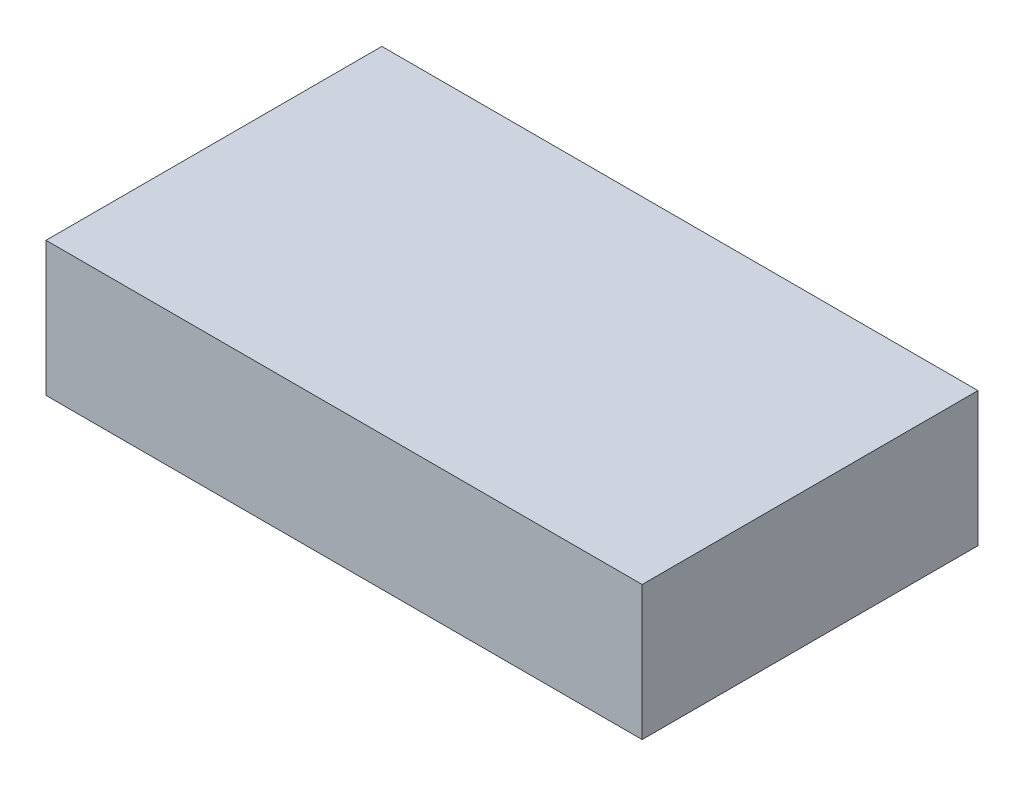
ISO-10303-21;
HEADER;
FILE_DESCRIPTION(('STEP AP214'),'2;1');
FILE_NAME('part.step','',(''),(''),'','','');
FILE_SCHEMA(('AUTOMOTIVE_DESIGN { 1 0 10303 214 1 1 1 1 }'));
ENDSEC;
DATA;
#1=APPLICATION_CONTEXT('core data for automotive mechanical design processes');
#2=APPLICATION_PROTOCOL_DEFINITION('international standard','automotive_design',2000,#1);
#3=PRODUCT_CONTEXT('',#1,'mechanical');
#4=PRODUCT('Part','Part','',(#3));
#5=PRODUCT_RELATED_PRODUCT_CATEGORY('part','',(#4));
#6=PRODUCT_DEFINITION_FORMATION('','',#4);
#7=PRODUCT_DEFINITION_CONTEXT('part definition',#1,'design');
#8=PRODUCT_DEFINITION('design','',#6,#7);
#9=PRODUCT_DEFINITION_SHAPE('','',#8);
#10=(LENGTH_UNIT() NAMED_UNIT(*) SI_UNIT(.MILLI.,.METRE.));
#11=(NAMED_UNIT(*) PLANE_ANGLE_UNIT() SI_UNIT($,.RADIAN.));
#12=(NAMED_UNIT(*) SI_UNIT($,.STERADIAN.) SOLID_ANGLE_UNIT());
#13=UNCERTAINTY_MEASURE_WITH_UNIT(LENGTH_MEASURE(1.E-05),#10,'distance_accuracy_value','');
#14=(GEOMETRIC_REPRESENTATION_CONTEXT(3) GLOBAL_UNCERTAINTY_ASSIGNED_CONTEXT((#13)) GLOBAL_UNIT_ASSIGNED_CONTEXT((#10,
#11,#12)) REPRESENTATION_CONTEXT('',''));
#15=CARTESIAN_POINT('',(0.,0.,0.));
#16=DIRECTION('',(0.,0.,1.));
#17=DIRECTION('',(1.,0.,0.));
#18=AXIS2_PLACEMENT_3D('',#15,#16,#17);
#19=CARTESIAN_POINT('',(-15.9566770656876,8.,-7.50963752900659));
#20=DIRECTION('',(1.,0.,0.));
#21=DIRECTION('',(0.,0.,-1.));
#22=AXIS2_PLACEMENT_3D('',#19,#20,#21);
#23=PLANE('',#22);
#24=DIRECTION('',(0.,0.,1.));
#25=VECTOR('',#24,1.);
#26=CARTESIAN_POINT('',(-15.9566770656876,0.,-7.50963752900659));
#27=LINE('',#26,#25);
#28=CARTESIAN_POINT('',(-15.9566770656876,0.,-7.50963752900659));
#29=VERTEX_POINT('',#28);
#30=CARTESIAN_POINT('',(-15.9566770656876,0.,12.4903624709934));
#31=VERTEX_POINT('',#30);
#32=EDGE_CURVE('E100',#29,#31,#27,.T.);
#33=ORIENTED_EDGE('',*,*,#32,.T.);
#34=DIRECTION('',(0.,-1.,0.));
#35=VECTOR('',#34,1.);
#36=CARTESIAN_POINT('',(-15.9566770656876,8.,12.4903624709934));
#37=LINE('',#36,#35);
#38=CARTESIAN_POINT('',(-15.9566770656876,8.,12.4903624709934));
#39=VERTEX_POINT('',#38);
#40=EDGE_CURVE('E11',#39,#31,#37,.T.);
#41=ORIENTED_EDGE('',*,*,#40,.F.);
#42=DIRECTION('',(0.,0.,1.));
#43=VECTOR('',#42,1.);
#44=CARTESIAN_POINT('',(-15.9566770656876,8.,-7.50963752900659));
#45=LINE('',#44,#43);
#46=CARTESIAN_POINT('',(-15.9566770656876,8.,-7.50963752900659));
#47=VERTEX_POINT('',#46);
#48=EDGE_CURVE('E88',#47,#39,#45,.T.);
#49=ORIENTED_EDGE('',*,*,#48,.F.);
#50=DIRECTION('',(0.,-1.,0.));
#51=VECTOR('',#50,1.);
#52=CARTESIAN_POINT('',(-15.9566770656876,8.,-7.50963752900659));
#53=LINE('',#52,#51);
#54=EDGE_CURVE('E96',#47,#29,#53,.T.);
#55=ORIENTED_EDGE('',*,*,#54,.T.);
#56=EDGE_LOOP('',(#33,#41,#49,#55));
#57=FACE_BOUND('',#56,.T.);
#58=ADVANCED_FACE('F37',(#57),#23,.F.);
#59=CARTESIAN_POINT('',(-15.9566770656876,8.,12.4903624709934));
#60=DIRECTION('',(0.,0.,-1.));
#61=DIRECTION('',(-1.,0.,0.));
#62=AXIS2_PLACEMENT_3D('',#59,#60,#61);
#63=PLANE('',#62);
#64=DIRECTION('',(1.,0.,0.));
#65=VECTOR('',#64,1.);
#66=CARTESIAN_POINT('',(-15.9566770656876,0.,12.4903624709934));
#67=LINE('',#66,#65);
#68=CARTESIAN_POINT('',(19.5433229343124,0.,12.4903624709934));
#69=VERTEX_POINT('',#68);
#70=EDGE_CURVE('E92',#31,#69,#67,.T.);
#71=ORIENTED_EDGE('',*,*,#70,.T.);
#72=DIRECTION('',(0.,-1.,0.));
#73=VECTOR('',#72,1.);
#74=CARTESIAN_POINT('',(19.5433229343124,8.,12.4903624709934));
#75=LINE('',#74,#73);
#76=CARTESIAN_POINT('',(19.5433229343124,8.,12.4903624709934));
#77=VERTEX_POINT('',#76);
#78=EDGE_CURVE('E45',#77,#69,#75,.T.);
#79=ORIENTED_EDGE('',*,*,#78,.F.);
#80=DIRECTION('',(1.,0.,0.));
#81=VECTOR('',#80,1.);
#82=CARTESIAN_POINT('',(-15.9566770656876,8.,12.4903624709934));
#83=LINE('',#82,#81);
#84=EDGE_CURVE('E83',#39,#77,#83,.T.);
#85=ORIENTED_EDGE('',*,*,#84,.F.);
#86=ORIENTED_EDGE('',*,*,#40,.T.);
#87=EDGE_LOOP('',(#71,#79,#85,#86));
#88=FACE_BOUND('',#87,.T.);
#89=ADVANCED_FACE('F91',(#88),#63,.F.);
#90=CARTESIAN_POINT('',(19.5433229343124,8.,-7.50963752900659));
#91=DIRECTION('',(-1.,0.,0.));
#92=DIRECTION('',(0.,0.,1.));
#93=AXIS2_PLACEMENT_3D('',#90,#91,#92);
#94=PLANE('',#93);
#95=DIRECTION('',(0.,0.,-1.));
#96=VECTOR('',#95,1.);
#97=CARTESIAN_POINT('',(19.5433229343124,0.,-7.50963752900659));
#98=LINE('',#97,#96);
#99=CARTESIAN_POINT('',(19.5433229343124,0.,-7.50963752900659));
#100=VERTEX_POINT('',#99);
#101=EDGE_CURVE('E70',#69,#100,#98,.T.);
#102=ORIENTED_EDGE('',*,*,#101,.T.);
#103=DIRECTION('',(0.,-1.,0.));
#104=VECTOR('',#103,1.);
#105=CARTESIAN_POINT('',(19.5433229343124,8.,-7.50963752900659));
#106=LINE('',#105,#104);
#107=CARTESIAN_POINT('',(19.5433229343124,8.,-7.50963752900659));
#108=VERTEX_POINT('',#107);
#109=EDGE_CURVE('E93',#108,#100,#106,.T.);
#110=ORIENTED_EDGE('',*,*,#109,.F.);
#111=DIRECTION('',(0.,0.,-1.));
#112=VECTOR('',#111,1.);
#113=CARTESIAN_POINT('',(19.5433229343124,8.,-7.50963752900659));
#114=LINE('',#113,#112);
#115=EDGE_CURVE('E86',#77,#108,#114,.T.);
#116=ORIENTED_EDGE('',*,*,#115,.F.);
#117=ORIENTED_EDGE('',*,*,#78,.T.);
#118=EDGE_LOOP('',(#102,#110,#116,#117));
#119=FACE_BOUND('',#118,.T.);
#120=ADVANCED_FACE('F94',(#119),#94,.F.);
#121=CARTESIAN_POINT('',(-15.9566770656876,8.,-7.50963752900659));
#122=DIRECTION('',(0.,0.,1.));
#123=DIRECTION('',(1.,0.,0.));
#124=AXIS2_PLACEMENT_3D('',#121,#122,#123);
#125=PLANE('',#124);
#126=DIRECTION('',(-1.,0.,0.));
#127=VECTOR('',#126,1.);
#128=CARTESIAN_POINT('',(-15.9566770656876,0.,-7.50963752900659));
#129=LINE('',#128,#127);
#130=EDGE_CURVE('E76',#100,#29,#129,.T.);
#131=ORIENTED_EDGE('',*,*,#130,.T.);
#132=ORIENTED_EDGE('',*,*,#54,.F.);
#133=DIRECTION('',(-1.,0.,0.));
#134=VECTOR('',#133,1.);
#135=CARTESIAN_POINT('',(-15.9566770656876,8.,-7.50963752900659));
#136=LINE('',#135,#134);
#137=EDGE_CURVE('E53',#108,#47,#136,.T.);
#138=ORIENTED_EDGE('',*,*,#137,.F.);
#139=ORIENTED_EDGE('',*,*,#109,.T.);
#140=EDGE_LOOP('',(#131,#132,#138,#139));
#141=FACE_BOUND('',#140,.T.);
#142=ADVANCED_FACE('F107',(#141),#125,.F.);
#143=CARTESIAN_POINT('',(0.,8.,0.));
#144=DIRECTION('',(0.,1.,0.));
#145=DIRECTION('',(0.,0.,1.));
#146=AXIS2_PLACEMENT_3D('',#143,#144,#145);
#147=PLANE('',#146);
#148=ORIENTED_EDGE('',*,*,#48,.T.);
#149=ORIENTED_EDGE('',*,*,#84,.T.);
#150=ORIENTED_EDGE('',*,*,#115,.T.);
#151=ORIENTED_EDGE('',*,*,#137,.T.);
#152=EDGE_LOOP('',(#148,#149,#150,#151));
#153=FACE_BOUND('',#152,.T.);
#154=ADVANCED_FACE('F84',(#153),#147,.T.);
#155=CARTESIAN_POINT('',(0.,0.,0.));
#156=DIRECTION('',(0.,1.,0.));
#157=DIRECTION('',(0.,0.,1.));
#158=AXIS2_PLACEMENT_3D('',#155,#156,#157);
#159=PLANE('',#158);
#160=ORIENTED_EDGE('',*,*,#32,.F.);
#161=ORIENTED_EDGE('',*,*,#130,.F.);
#162=ORIENTED_EDGE('',*,*,#101,.F.);
#163=ORIENTED_EDGE('',*,*,#70,.F.);
#164=EDGE_LOOP('',(#160,#161,#162,#163));
#165=FACE_BOUND('',#164,.T.);
#166=ADVANCED_FACE('F110',(#165),#159,.F.);
#167=CLOSED_SHELL('',(#58,#89,#120,#142,#154,#166));
#168=MANIFOLD_SOLID_BREP('B2',#167);
#169=ADVANCED_BREP_SHAPE_REPRESENTATION('',(#18,#168),#14);
#170=SHAPE_DEFINITION_REPRESENTATION(#9,#169);
ENDSEC;
END-ISO-10303-21;
